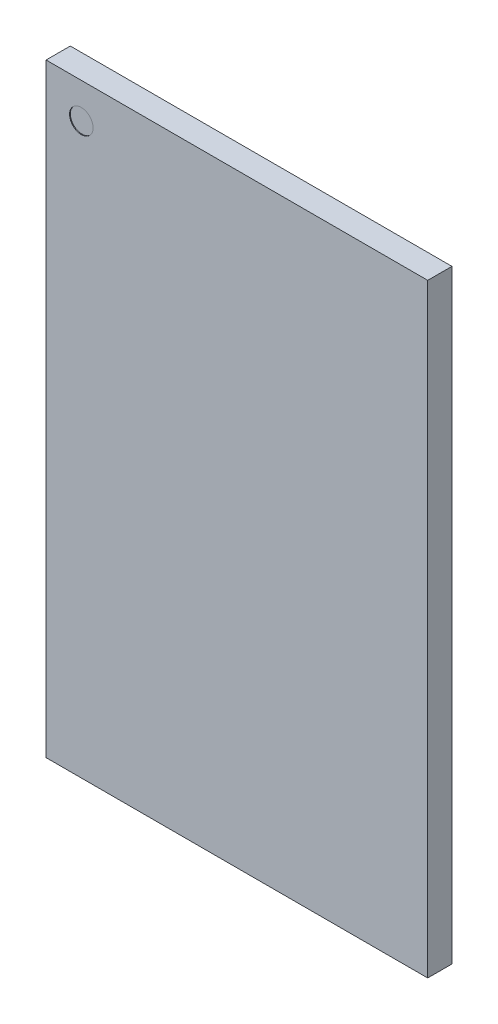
ISO-10303-21;
HEADER;
FILE_DESCRIPTION(('STEP AP214'),'2;1');
FILE_NAME('part.step','',(''),(''),'','','');
FILE_SCHEMA(('AUTOMOTIVE_DESIGN { 1 0 10303 214 1 1 1 1 }'));
ENDSEC;
DATA;
#1=APPLICATION_CONTEXT('core data for automotive mechanical design processes');
#2=APPLICATION_PROTOCOL_DEFINITION('international standard','automotive_design',2000,#1);
#3=PRODUCT_CONTEXT('',#1,'mechanical');
#4=PRODUCT('Part','Part','',(#3));
#5=PRODUCT_RELATED_PRODUCT_CATEGORY('part','',(#4));
#6=PRODUCT_DEFINITION_FORMATION('','',#4);
#7=PRODUCT_DEFINITION_CONTEXT('part definition',#1,'design');
#8=PRODUCT_DEFINITION('design','',#6,#7);
#9=PRODUCT_DEFINITION_SHAPE('','',#8);
#10=(LENGTH_UNIT() NAMED_UNIT(*) SI_UNIT(.MILLI.,.METRE.));
#11=(NAMED_UNIT(*) PLANE_ANGLE_UNIT() SI_UNIT($,.RADIAN.));
#12=(NAMED_UNIT(*) SI_UNIT($,.STERADIAN.) SOLID_ANGLE_UNIT());
#13=UNCERTAINTY_MEASURE_WITH_UNIT(LENGTH_MEASURE(1.E-05),#10,'distance_accuracy_value','');
#14=(GEOMETRIC_REPRESENTATION_CONTEXT(3) GLOBAL_UNCERTAINTY_ASSIGNED_CONTEXT((#13)) GLOBAL_UNIT_ASSIGNED_CONTEXT((#10,
#11,#12)) REPRESENTATION_CONTEXT('',''));
#15=CARTESIAN_POINT('',(0.,0.,0.));
#16=DIRECTION('',(0.,0.,1.));
#17=DIRECTION('',(1.,0.,0.));
#18=AXIS2_PLACEMENT_3D('',#15,#16,#17);
#19=CARTESIAN_POINT('',(0.,0.,0.44200000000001));
#20=DIRECTION('',(0.,0.,1.));
#21=DIRECTION('',(1.,0.,0.));
#22=AXIS2_PLACEMENT_3D('',#19,#20,#21);
#23=PLANE('',#22);
#24=CARTESIAN_POINT('',(-1.98499999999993,3.40499999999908,0.44200000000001));
#25=DIRECTION('',(0.,0.,1.));
#26=DIRECTION('',(1.,0.,0.));
#27=AXIS2_PLACEMENT_3D('',#24,#25,#26);
#28=CIRCLE('',#27,0.15000000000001);
#29=CARTESIAN_POINT('',(-1.83499999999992,3.40499999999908,0.44200000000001));
#30=VERTEX_POINT('',#29);
#31=EDGE_CURVE('E19',#30,#30,#28,.T.);
#32=ORIENTED_EDGE('',*,*,#31,.T.);
#33=EDGE_LOOP('',(#32));
#34=FACE_BOUND('',#33,.T.);
#35=ADVANCED_FACE('F16',(#34),#23,.T.);
#36=CARTESIAN_POINT('',(-1.98499999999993,3.40499999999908,0.45199999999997));
#37=DIRECTION('',(0.,0.,1.));
#38=DIRECTION('',(1.,0.,0.));
#39=AXIS2_PLACEMENT_3D('',#36,#37,#38);
#40=CYLINDRICAL_SURFACE('',#39,0.15000000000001);
#41=ORIENTED_EDGE('',*,*,#31,.F.);
#42=EDGE_LOOP('',(#41));
#43=FACE_BOUND('',#42,.T.);
#44=CARTESIAN_POINT('',(-1.98499999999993,3.40499999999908,0.45199999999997));
#45=DIRECTION('',(0.,0.,1.));
#46=DIRECTION('',(1.,0.,0.));
#47=AXIS2_PLACEMENT_3D('',#44,#45,#46);
#48=CIRCLE('',#47,0.15000000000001);
#49=CARTESIAN_POINT('',(-1.83499999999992,3.40499999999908,0.45199999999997));
#50=VERTEX_POINT('',#49);
#51=EDGE_CURVE('E74',#50,#50,#48,.F.);
#52=ORIENTED_EDGE('',*,*,#51,.F.);
#53=EDGE_LOOP('',(#52));
#54=FACE_BOUND('',#53,.T.);
#55=ADVANCED_FACE('F89',(#43,#54),#40,.F.);
#56=CARTESIAN_POINT('',(0.,0.,0.45199999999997));
#57=DIRECTION('',(0.,0.,1.));
#58=DIRECTION('',(1.,0.,0.));
#59=AXIS2_PLACEMENT_3D('',#56,#57,#58);
#60=PLANE('',#59);
#61=ORIENTED_EDGE('',*,*,#51,.T.);
#62=EDGE_LOOP('',(#61));
#63=FACE_BOUND('',#62,.T.);
#64=DIRECTION('',(1.,0.,0.));
#65=VECTOR('',#64,1.);
#66=CARTESIAN_POINT('',(2.43499999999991,3.85499999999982,0.45199999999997));
#67=LINE('',#66,#65);
#68=CARTESIAN_POINT('',(-2.43499999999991,3.85499999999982,0.45199999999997));
#69=VERTEX_POINT('',#68);
#70=CARTESIAN_POINT('',(2.43499999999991,3.85499999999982,0.45199999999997));
#71=VERTEX_POINT('',#70);
#72=EDGE_CURVE('E70',#69,#71,#67,.T.);
#73=ORIENTED_EDGE('',*,*,#72,.F.);
#74=DIRECTION('',(0.,1.,0.));
#75=VECTOR('',#74,1.);
#76=CARTESIAN_POINT('',(-2.43499999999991,3.85499999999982,0.45199999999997));
#77=LINE('',#76,#75);
#78=CARTESIAN_POINT('',(-2.43499999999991,-3.85499999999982,0.45199999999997));
#79=VERTEX_POINT('',#78);
#80=EDGE_CURVE('E66',#79,#69,#77,.T.);
#81=ORIENTED_EDGE('',*,*,#80,.F.);
#82=DIRECTION('',(1.,0.,0.));
#83=VECTOR('',#82,1.);
#84=CARTESIAN_POINT('',(-2.43499999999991,-3.85499999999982,0.45199999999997));
#85=LINE('',#84,#83);
#86=CARTESIAN_POINT('',(2.43499999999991,-3.85499999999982,0.45199999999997));
#87=VERTEX_POINT('',#86);
#88=EDGE_CURVE('E57',#87,#79,#85,.F.);
#89=ORIENTED_EDGE('',*,*,#88,.F.);
#90=DIRECTION('',(0.,1.,0.));
#91=VECTOR('',#90,1.);
#92=CARTESIAN_POINT('',(2.43499999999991,-3.85499999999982,0.45199999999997));
#93=LINE('',#92,#91);
#94=EDGE_CURVE('E52',#71,#87,#93,.F.);
#95=ORIENTED_EDGE('',*,*,#94,.F.);
#96=EDGE_LOOP('',(#73,#81,#89,#95));
#97=FACE_BOUND('',#96,.T.);
#98=ADVANCED_FACE('F69',(#63,#97),#60,.T.);
#99=CARTESIAN_POINT('',(-2.43499999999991,3.85499999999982,0.));
#100=DIRECTION('',(-1.,0.,0.));
#101=DIRECTION('',(0.,0.,1.));
#102=AXIS2_PLACEMENT_3D('',#99,#100,#101);
#103=PLANE('',#102);
#104=DIRECTION('',(0.,0.,1.));
#105=VECTOR('',#104,1.);
#106=CARTESIAN_POINT('',(-2.43499999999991,3.85499999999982,0.));
#107=LINE('',#106,#105);
#108=CARTESIAN_POINT('',(-2.43499999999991,3.85499999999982,0.143000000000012));
#109=VERTEX_POINT('',#108);
#110=EDGE_CURVE('E197',#109,#69,#107,.T.);
#111=ORIENTED_EDGE('',*,*,#110,.F.);
#112=DIRECTION('',(0.,1.,0.));
#113=VECTOR('',#112,1.);
#114=CARTESIAN_POINT('',(-2.43499999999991,0.,0.143000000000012));
#115=LINE('',#114,#113);
#116=CARTESIAN_POINT('',(-2.43499999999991,-3.85499999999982,0.143000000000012));
#117=VERTEX_POINT('',#116);
#118=EDGE_CURVE('E78',#109,#117,#115,.F.);
#119=ORIENTED_EDGE('',*,*,#118,.T.);
#120=DIRECTION('',(0.,0.,-1.));
#121=VECTOR('',#120,1.);
#122=CARTESIAN_POINT('',(-2.43499999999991,-3.85499999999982,0.));
#123=LINE('',#122,#121);
#124=EDGE_CURVE('E62',#79,#117,#123,.T.);
#125=ORIENTED_EDGE('',*,*,#124,.F.);
#126=ORIENTED_EDGE('',*,*,#80,.T.);
#127=EDGE_LOOP('',(#111,#119,#125,#126));
#128=FACE_BOUND('',#127,.T.);
#129=ADVANCED_FACE('F77',(#128),#103,.T.);
#130=CARTESIAN_POINT('',(-2.43499999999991,-3.85499999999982,0.));
#131=DIRECTION('',(0.,-1.,0.));
#132=DIRECTION('',(0.,0.,-1.));
#133=AXIS2_PLACEMENT_3D('',#130,#131,#132);
#134=PLANE('',#133);
#135=ORIENTED_EDGE('',*,*,#124,.T.);
#136=DIRECTION('',(1.,0.,0.));
#137=VECTOR('',#136,1.);
#138=CARTESIAN_POINT('',(0.,-3.85499999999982,0.143000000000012));
#139=LINE('',#138,#137);
#140=CARTESIAN_POINT('',(2.43499999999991,-3.85499999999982,0.143000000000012));
#141=VERTEX_POINT('',#140);
#142=EDGE_CURVE('E198',#117,#141,#139,.T.);
#143=ORIENTED_EDGE('',*,*,#142,.T.);
#144=DIRECTION('',(0.,0.,-1.));
#145=VECTOR('',#144,1.);
#146=CARTESIAN_POINT('',(2.43499999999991,-3.85499999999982,0.));
#147=LINE('',#146,#145);
#148=EDGE_CURVE('E64',#87,#141,#147,.T.);
#149=ORIENTED_EDGE('',*,*,#148,.F.);
#150=ORIENTED_EDGE('',*,*,#88,.T.);
#151=EDGE_LOOP('',(#135,#143,#149,#150));
#152=FACE_BOUND('',#151,.T.);
#153=ADVANCED_FACE('F59',(#152),#134,.T.);
#154=CARTESIAN_POINT('',(2.43499999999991,-3.85499999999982,0.));
#155=DIRECTION('',(1.,0.,0.));
#156=DIRECTION('',(0.,0.,-1.));
#157=AXIS2_PLACEMENT_3D('',#154,#155,#156);
#158=PLANE('',#157);
#159=ORIENTED_EDGE('',*,*,#148,.T.);
#160=DIRECTION('',(0.,1.,0.));
#161=VECTOR('',#160,1.);
#162=CARTESIAN_POINT('',(2.43499999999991,0.,0.143000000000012));
#163=LINE('',#162,#161);
#164=CARTESIAN_POINT('',(2.43499999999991,3.85499999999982,0.143000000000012));
#165=VERTEX_POINT('',#164);
#166=EDGE_CURVE('E25',#141,#165,#163,.T.);
#167=ORIENTED_EDGE('',*,*,#166,.T.);
#168=DIRECTION('',(0.,0.,1.));
#169=VECTOR('',#168,1.);
#170=CARTESIAN_POINT('',(2.43499999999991,3.85499999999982,0.));
#171=LINE('',#170,#169);
#172=EDGE_CURVE('E33',#71,#165,#171,.F.);
#173=ORIENTED_EDGE('',*,*,#172,.F.);
#174=ORIENTED_EDGE('',*,*,#94,.T.);
#175=EDGE_LOOP('',(#159,#167,#173,#174));
#176=FACE_BOUND('',#175,.T.);
#177=ADVANCED_FACE('F106',(#176),#158,.T.);
#178=CARTESIAN_POINT('',(2.43499999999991,3.85499999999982,0.));
#179=DIRECTION('',(0.,1.,0.));
#180=DIRECTION('',(0.,0.,1.));
#181=AXIS2_PLACEMENT_3D('',#178,#179,#180);
#182=PLANE('',#181);
#183=ORIENTED_EDGE('',*,*,#172,.T.);
#184=DIRECTION('',(1.,0.,0.));
#185=VECTOR('',#184,1.);
#186=CARTESIAN_POINT('',(0.,3.85499999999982,0.143000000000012));
#187=LINE('',#186,#185);
#188=EDGE_CURVE('E11',#165,#109,#187,.F.);
#189=ORIENTED_EDGE('',*,*,#188,.T.);
#190=ORIENTED_EDGE('',*,*,#110,.T.);
#191=ORIENTED_EDGE('',*,*,#72,.T.);
#192=EDGE_LOOP('',(#183,#189,#190,#191));
#193=FACE_BOUND('',#192,.T.);
#194=ADVANCED_FACE('F100',(#193),#182,.T.);
#195=CARTESIAN_POINT('',(0.,0.,0.143000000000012));
#196=DIRECTION('',(0.,0.,1.));
#197=DIRECTION('',(1.,0.,0.));
#198=AXIS2_PLACEMENT_3D('',#195,#196,#197);
#199=PLANE('',#198);
#200=ORIENTED_EDGE('',*,*,#166,.F.);
#201=ORIENTED_EDGE('',*,*,#142,.F.);
#202=ORIENTED_EDGE('',*,*,#118,.F.);
#203=ORIENTED_EDGE('',*,*,#188,.F.);
#204=EDGE_LOOP('',(#200,#201,#202,#203));
#205=FACE_BOUND('',#204,.T.);
#206=ADVANCED_FACE('F98',(#205),#199,.F.);
#207=CLOSED_SHELL('',(#35,#55,#98,#129,#153,#177,#194,#206));
#208=MANIFOLD_SOLID_BREP('B1',#207);
#209=ADVANCED_BREP_SHAPE_REPRESENTATION('',(#18,#208),#14);
#210=SHAPE_DEFINITION_REPRESENTATION(#9,#209);
ENDSEC;
END-ISO-10303-21;
